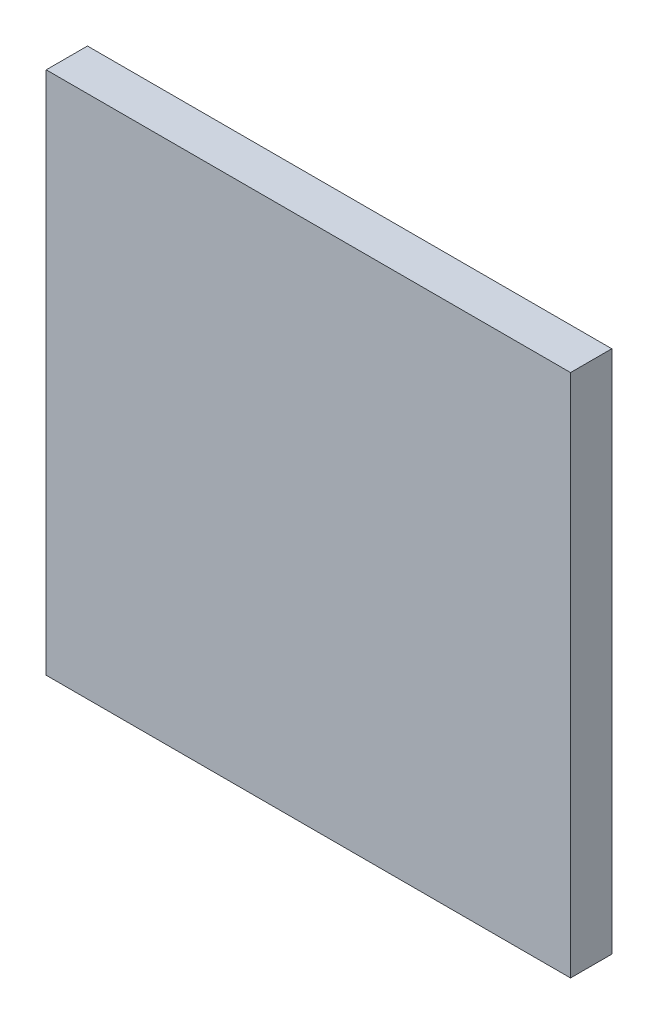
from build123d import *

# Parameters (mm, degrees)
SKETCH1_W           = 38.1
SKETCH1_H           = 38.1
BOSS_EXTRUDE1_DEPTH = 2.9972


with BuildPart() as part:
    # Sketch1 → Boss-Extrude1 (new body)
    with BuildSketch(Plane.XY):
        with Locations((19.05, 19.05)):
            Rectangle(SKETCH1_W, SKETCH1_H)
    extrude(amount=BOSS_EXTRUDE1_DEPTH)


solid = part.part
